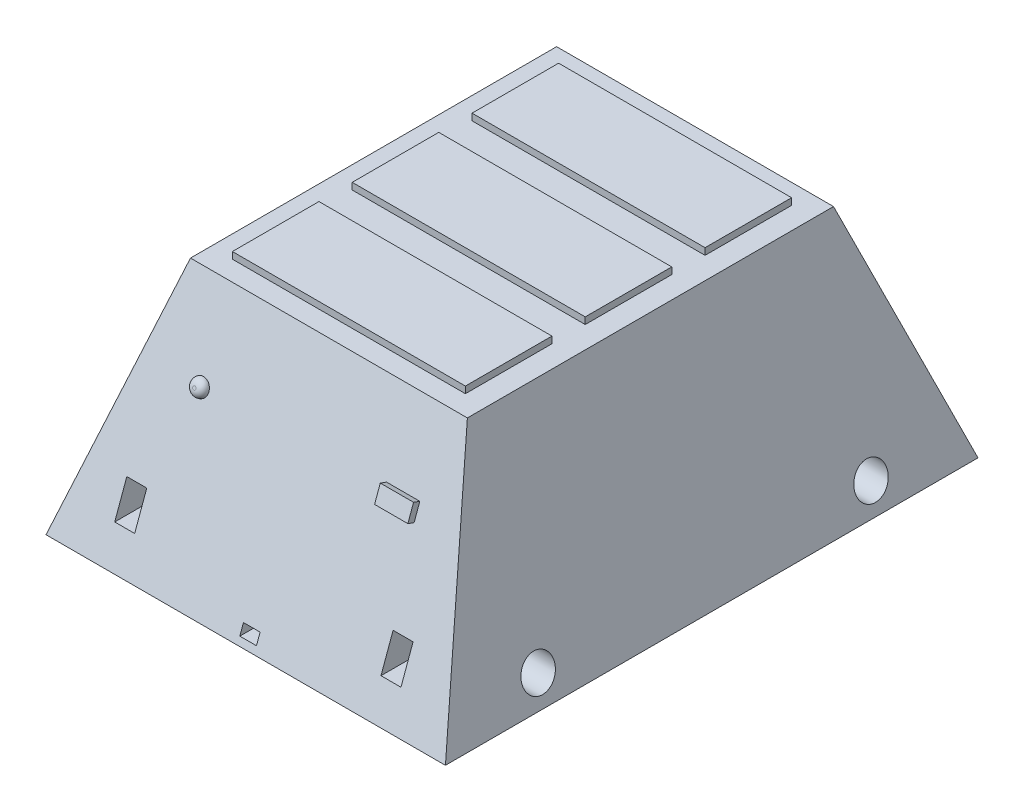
ISO-10303-21;
HEADER;
FILE_DESCRIPTION(('STEP AP214'),'2;1');
FILE_NAME('part.step','',(''),(''),'','','');
FILE_SCHEMA(('AUTOMOTIVE_DESIGN { 1 0 10303 214 1 1 1 1 }'));
ENDSEC;
DATA;
#1=APPLICATION_CONTEXT('core data for automotive mechanical design processes');
#2=APPLICATION_PROTOCOL_DEFINITION('international standard','automotive_design',2000,#1);
#3=PRODUCT_CONTEXT('',#1,'mechanical');
#4=PRODUCT('Part','Part','',(#3));
#5=PRODUCT_RELATED_PRODUCT_CATEGORY('part','',(#4));
#6=PRODUCT_DEFINITION_FORMATION('','',#4);
#7=PRODUCT_DEFINITION_CONTEXT('part definition',#1,'design');
#8=PRODUCT_DEFINITION('design','',#6,#7);
#9=PRODUCT_DEFINITION_SHAPE('','',#8);
#10=(LENGTH_UNIT() NAMED_UNIT(*) SI_UNIT(.MILLI.,.METRE.));
#11=(NAMED_UNIT(*) PLANE_ANGLE_UNIT() SI_UNIT($,.RADIAN.));
#12=(NAMED_UNIT(*) SI_UNIT($,.STERADIAN.) SOLID_ANGLE_UNIT());
#13=UNCERTAINTY_MEASURE_WITH_UNIT(LENGTH_MEASURE(1.E-05),#10,'distance_accuracy_value','');
#14=(GEOMETRIC_REPRESENTATION_CONTEXT(3) GLOBAL_UNCERTAINTY_ASSIGNED_CONTEXT((#13)) GLOBAL_UNIT_ASSIGNED_CONTEXT((#10,
#11,#12)) REPRESENTATION_CONTEXT('',''));
#15=CARTESIAN_POINT('',(0.,0.,0.));
#16=DIRECTION('',(0.,0.,1.));
#17=DIRECTION('',(1.,0.,0.));
#18=AXIS2_PLACEMENT_3D('',#15,#16,#17);
#19=CARTESIAN_POINT('',(76.2,43.6162040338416,69.85));
#20=DIRECTION('',(0.,-0.342020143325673,-0.939692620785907));
#21=DIRECTION('',(0.,0.939692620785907,-0.342020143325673));
#22=AXIS2_PLACEMENT_3D('',#19,#20,#21);
#23=PLANE('',#22);
#24=DIRECTION('',(-1.,0.,0.));
#25=VECTOR('',#24,1.);
#26=CARTESIAN_POINT('',(-54.61,-30.9162040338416,96.9775780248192));
#27=LINE('',#26,#25);
#28=CARTESIAN_POINT('',(-46.99,-30.9162040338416,96.9775780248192));
#29=VERTEX_POINT('',#28);
#30=CARTESIAN_POINT('',(-54.61,-30.9162040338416,96.9775780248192));
#31=VERTEX_POINT('',#30);
#32=EDGE_CURVE('E293',#29,#31,#27,.T.);
#33=ORIENTED_EDGE('',*,*,#32,.T.);
#34=DIRECTION('',(0.,0.939692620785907,-0.342020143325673));
#35=VECTOR('',#34,1.);
#36=CARTESIAN_POINT('',(-54.61,-23.8717981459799,94.4136239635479));
#37=LINE('',#36,#35);
#38=CARTESIAN_POINT('',(-54.61,-18.2162040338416,92.3551560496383));
#39=VERTEX_POINT('',#38);
#40=EDGE_CURVE('E289',#31,#39,#37,.T.);
#41=ORIENTED_EDGE('',*,*,#40,.T.);
#42=DIRECTION('',(1.,0.,0.));
#43=VECTOR('',#42,1.);
#44=CARTESIAN_POINT('',(-54.61,-18.2162040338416,92.3551560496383));
#45=LINE('',#44,#43);
#46=CARTESIAN_POINT('',(-46.99,-18.2162040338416,92.3551560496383));
#47=VERTEX_POINT('',#46);
#48=EDGE_CURVE('E292',#39,#47,#45,.T.);
#49=ORIENTED_EDGE('',*,*,#48,.T.);
#50=DIRECTION('',(0.,-0.939692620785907,0.342020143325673));
#51=VECTOR('',#50,1.);
#52=CARTESIAN_POINT('',(-46.99,-23.8717981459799,94.4136239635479));
#53=LINE('',#52,#51);
#54=EDGE_CURVE('E296',#47,#29,#53,.T.);
#55=ORIENTED_EDGE('',*,*,#54,.T.);
#56=EDGE_LOOP('',(#33,#41,#49,#55));
#57=FACE_BOUND('',#56,.T.);
#58=CARTESIAN_POINT('',(-38.1,13.7809633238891,80.7091395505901));
#59=DIRECTION('',(0.,-0.342020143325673,-0.939692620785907));
#60=DIRECTION('',(0.,0.939692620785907,-0.342020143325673));
#61=AXIS2_PLACEMENT_3D('',#58,#59,#60);
#62=CIRCLE('',#61,3.175);
#63=CARTESIAN_POINT('',(-38.1,16.7644873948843,79.6232255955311));
#64=VERTEX_POINT('',#63);
#65=EDGE_CURVE('E52',#64,#64,#62,.F.);
#66=ORIENTED_EDGE('',*,*,#65,.F.);
#67=EDGE_LOOP('',(#66));
#68=FACE_BOUND('',#67,.T.);
#69=DIRECTION('',(0.,0.939692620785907,-0.342020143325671));
#70=VECTOR('',#69,1.);
#71=CARTESIAN_POINT('',(44.45,16.7644873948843,79.6232255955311));
#72=LINE('',#71,#70);
#73=CARTESIAN_POINT('',(44.45,10.7974392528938,81.7950535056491));
#74=VERTEX_POINT('',#73);
#75=CARTESIAN_POINT('',(44.45,16.7644873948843,79.6232255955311));
#76=VERTEX_POINT('',#75);
#77=EDGE_CURVE('E474',#74,#76,#72,.T.);
#78=ORIENTED_EDGE('',*,*,#77,.F.);
#79=DIRECTION('',(1.,0.,0.));
#80=VECTOR('',#79,1.);
#81=CARTESIAN_POINT('',(31.75,10.7974392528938,81.7950535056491));
#82=LINE('',#81,#80);
#83=CARTESIAN_POINT('',(31.75,10.7974392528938,81.7950535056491));
#84=VERTEX_POINT('',#83);
#85=EDGE_CURVE('E464',#84,#74,#82,.T.);
#86=ORIENTED_EDGE('',*,*,#85,.F.);
#87=DIRECTION('',(0.,-0.939692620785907,0.342020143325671));
#88=VECTOR('',#87,1.);
#89=CARTESIAN_POINT('',(31.75,16.7644873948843,79.6232255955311));
#90=LINE('',#89,#88);
#91=CARTESIAN_POINT('',(31.75,16.7644873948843,79.6232255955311));
#92=VERTEX_POINT('',#91);
#93=EDGE_CURVE('E467',#92,#84,#90,.T.);
#94=ORIENTED_EDGE('',*,*,#93,.F.);
#95=DIRECTION('',(-1.,0.,0.));
#96=VECTOR('',#95,1.);
#97=CARTESIAN_POINT('',(31.75,16.7644873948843,79.6232255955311));
#98=LINE('',#97,#96);
#99=EDGE_CURVE('E471',#76,#92,#98,.T.);
#100=ORIENTED_EDGE('',*,*,#99,.F.);
#101=EDGE_LOOP('',(#78,#86,#94,#100));
#102=FACE_BOUND('',#101,.T.);
#103=DIRECTION('',(0.24416888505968,0.911250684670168,-0.331668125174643));
#104=VECTOR('',#103,1.);
#105=CARTESIAN_POINT('',(-45.1338085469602,72.3244008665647,59.4010708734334));
#106=LINE('',#105,#104);
#107=CARTESIAN_POINT('',(-52.8261467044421,43.6162040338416,69.85));
#108=VERTEX_POINT('',#107);
#109=CARTESIAN_POINT('',(-76.2,-43.6162040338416,101.6));
#110=VERTEX_POINT('',#109);
#111=EDGE_CURVE('E492',#108,#110,#106,.F.);
#112=ORIENTED_EDGE('',*,*,#111,.T.);
#113=DIRECTION('',(-1.,0.,0.));
#114=VECTOR('',#113,1.);
#115=CARTESIAN_POINT('',(76.2,-43.6162040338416,101.6));
#116=LINE('',#115,#114);
#117=CARTESIAN_POINT('',(76.2,-43.6162040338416,101.6));
#118=VERTEX_POINT('',#117);
#119=EDGE_CURVE('E514',#118,#110,#116,.T.);
#120=ORIENTED_EDGE('',*,*,#119,.F.);
#121=DIRECTION('',(0.24416888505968,-0.911250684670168,0.331668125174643));
#122=VECTOR('',#121,1.);
#123=CARTESIAN_POINT('',(54.2196594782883,38.4155435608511,71.7428856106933));
#124=LINE('',#123,#122);
#125=CARTESIAN_POINT('',(52.8261467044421,43.6162040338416,69.85));
#126=VERTEX_POINT('',#125);
#127=EDGE_CURVE('E500',#126,#118,#124,.T.);
#128=ORIENTED_EDGE('',*,*,#127,.F.);
#129=DIRECTION('',(-1.,0.,0.));
#130=VECTOR('',#129,1.);
#131=CARTESIAN_POINT('',(76.2,43.6162040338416,69.85));
#132=LINE('',#131,#130);
#133=EDGE_CURVE('E504',#126,#108,#132,.T.);
#134=ORIENTED_EDGE('',*,*,#133,.T.);
#135=EDGE_LOOP('',(#112,#120,#128,#134));
#136=FACE_BOUND('',#135,.T.);
#137=DIRECTION('',(-1.,0.,0.));
#138=VECTOR('',#137,1.);
#139=CARTESIAN_POINT('',(46.99,-30.9162040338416,96.9775780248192));
#140=LINE('',#139,#138);
#141=CARTESIAN_POINT('',(54.61,-30.9162040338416,96.9775780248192));
#142=VERTEX_POINT('',#141);
#143=CARTESIAN_POINT('',(46.99,-30.9162040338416,96.9775780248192));
#144=VERTEX_POINT('',#143);
#145=EDGE_CURVE('E322',#142,#144,#140,.T.);
#146=ORIENTED_EDGE('',*,*,#145,.T.);
#147=DIRECTION('',(0.,0.939692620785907,-0.342020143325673));
#148=VECTOR('',#147,1.);
#149=CARTESIAN_POINT('',(46.99,-23.8717981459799,94.4136239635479));
#150=LINE('',#149,#148);
#151=CARTESIAN_POINT('',(46.99,-18.2162040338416,92.3551560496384));
#152=VERTEX_POINT('',#151);
#153=EDGE_CURVE('E326',#144,#152,#150,.T.);
#154=ORIENTED_EDGE('',*,*,#153,.T.);
#155=DIRECTION('',(1.,0.,0.));
#156=VECTOR('',#155,1.);
#157=CARTESIAN_POINT('',(46.99,-18.2162040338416,92.3551560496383));
#158=LINE('',#157,#156);
#159=CARTESIAN_POINT('',(54.61,-18.2162040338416,92.3551560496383));
#160=VERTEX_POINT('',#159);
#161=EDGE_CURVE('E348',#152,#160,#158,.T.);
#162=ORIENTED_EDGE('',*,*,#161,.T.);
#163=DIRECTION('',(0.,-0.939692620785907,0.342020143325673));
#164=VECTOR('',#163,1.);
#165=CARTESIAN_POINT('',(54.61,-23.8717981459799,94.4136239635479));
#166=LINE('',#165,#164);
#167=EDGE_CURVE('E345',#160,#142,#166,.T.);
#168=ORIENTED_EDGE('',*,*,#167,.T.);
#169=EDGE_LOOP('',(#146,#154,#162,#168));
#170=FACE_BOUND('',#169,.T.);
#171=DIRECTION('',(-1.,0.,0.));
#172=VECTOR('',#171,1.);
#173=CARTESIAN_POINT('',(-3.175,-41.0762040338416,100.675515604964));
#174=LINE('',#173,#172);
#175=CARTESIAN_POINT('',(3.175,-41.0762040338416,100.675515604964));
#176=VERTEX_POINT('',#175);
#177=CARTESIAN_POINT('',(-3.175,-41.0762040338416,100.675515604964));
#178=VERTEX_POINT('',#177);
#179=EDGE_CURVE('E260',#176,#178,#174,.T.);
#180=ORIENTED_EDGE('',*,*,#179,.T.);
#181=DIRECTION('',(0.,0.939692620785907,-0.342020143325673));
#182=VECTOR('',#181,1.);
#183=CARTESIAN_POINT('',(-3.175,-43.3097539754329,101.48846130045));
#184=LINE('',#183,#182);
#185=CARTESIAN_POINT('',(-3.175,-37.2662040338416,99.2887890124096));
#186=VERTEX_POINT('',#185);
#187=EDGE_CURVE('E288',#178,#186,#184,.T.);
#188=ORIENTED_EDGE('',*,*,#187,.T.);
#189=DIRECTION('',(1.,0.,0.));
#190=VECTOR('',#189,1.);
#191=CARTESIAN_POINT('',(-3.175,-37.2662040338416,99.2887890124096));
#192=LINE('',#191,#190);
#193=CARTESIAN_POINT('',(3.175,-37.2662040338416,99.2887890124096));
#194=VERTEX_POINT('',#193);
#195=EDGE_CURVE('E547',#186,#194,#192,.T.);
#196=ORIENTED_EDGE('',*,*,#195,.T.);
#197=DIRECTION('',(0.,-0.939692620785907,0.342020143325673));
#198=VECTOR('',#197,1.);
#199=CARTESIAN_POINT('',(3.175,-43.3097539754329,101.48846130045));
#200=LINE('',#199,#198);
#201=EDGE_CURVE('E257',#194,#176,#200,.T.);
#202=ORIENTED_EDGE('',*,*,#201,.T.);
#203=EDGE_LOOP('',(#180,#188,#196,#202));
#204=FACE_BOUND('',#203,.T.);
#205=ADVANCED_FACE('F44',(#57,#68,#102,#136,#170,#204),#23,.F.);
#206=CARTESIAN_POINT('',(76.2,43.6162040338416,-69.85));
#207=DIRECTION('',(0.,-1.,0.));
#208=DIRECTION('',(0.,0.,-1.));
#209=AXIS2_PLACEMENT_3D('',#206,#207,#208);
#210=PLANE('',#209);
#211=DIRECTION('',(0.,0.,-1.));
#212=VECTOR('',#211,1.);
#213=CARTESIAN_POINT('',(44.4499999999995,43.6162040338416,-62.23));
#214=LINE('',#213,#212);
#215=CARTESIAN_POINT('',(44.4499999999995,43.6162040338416,-29.21));
#216=VERTEX_POINT('',#215);
#217=CARTESIAN_POINT('',(44.4499999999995,43.6162040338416,-62.23));
#218=VERTEX_POINT('',#217);
#219=EDGE_CURVE('E364',#216,#218,#214,.T.);
#220=ORIENTED_EDGE('',*,*,#219,.F.);
#221=DIRECTION('',(1.,0.,0.));
#222=VECTOR('',#221,1.);
#223=CARTESIAN_POINT('',(-44.4500000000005,43.6162040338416,-29.21));
#224=LINE('',#223,#222);
#225=CARTESIAN_POINT('',(-44.4500000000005,43.6162040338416,-29.21));
#226=VERTEX_POINT('',#225);
#227=EDGE_CURVE('E357',#226,#216,#224,.T.);
#228=ORIENTED_EDGE('',*,*,#227,.F.);
#229=DIRECTION('',(0.,0.,1.));
#230=VECTOR('',#229,1.);
#231=CARTESIAN_POINT('',(-44.4500000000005,43.6162040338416,-62.23));
#232=LINE('',#231,#230);
#233=CARTESIAN_POINT('',(-44.4500000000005,43.6162040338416,-62.23));
#234=VERTEX_POINT('',#233);
#235=EDGE_CURVE('E371',#234,#226,#232,.T.);
#236=ORIENTED_EDGE('',*,*,#235,.F.);
#237=DIRECTION('',(-1.,0.,0.));
#238=VECTOR('',#237,1.);
#239=CARTESIAN_POINT('',(-44.4500000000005,43.6162040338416,-62.23));
#240=LINE('',#239,#238);
#241=EDGE_CURVE('E367',#218,#234,#240,.T.);
#242=ORIENTED_EDGE('',*,*,#241,.F.);
#243=EDGE_LOOP('',(#220,#228,#236,#242));
#244=FACE_BOUND('',#243,.T.);
#245=DIRECTION('',(0.,0.,-1.));
#246=VECTOR('',#245,1.);
#247=CARTESIAN_POINT('',(-52.8261467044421,43.6162040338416,-69.85));
#248=LINE('',#247,#246);
#249=CARTESIAN_POINT('',(-52.8261467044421,43.6162040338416,-69.85));
#250=VERTEX_POINT('',#249);
#251=EDGE_CURVE('E520',#250,#108,#248,.F.);
#252=ORIENTED_EDGE('',*,*,#251,.T.);
#253=ORIENTED_EDGE('',*,*,#133,.F.);
#254=DIRECTION('',(0.,0.,1.));
#255=VECTOR('',#254,1.);
#256=CARTESIAN_POINT('',(52.8261467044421,43.6162040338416,-69.85));
#257=LINE('',#256,#255);
#258=CARTESIAN_POINT('',(52.8261467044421,43.6162040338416,-69.85));
#259=VERTEX_POINT('',#258);
#260=EDGE_CURVE('E508',#259,#126,#257,.T.);
#261=ORIENTED_EDGE('',*,*,#260,.F.);
#262=DIRECTION('',(-1.,0.,0.));
#263=VECTOR('',#262,1.);
#264=CARTESIAN_POINT('',(76.2,43.6162040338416,-69.85));
#265=LINE('',#264,#263);
#266=EDGE_CURVE('E507',#259,#250,#265,.T.);
#267=ORIENTED_EDGE('',*,*,#266,.T.);
#268=EDGE_LOOP('',(#252,#253,#261,#267));
#269=FACE_BOUND('',#268,.T.);
#270=DIRECTION('',(0.,0.,-1.));
#271=VECTOR('',#270,1.);
#272=CARTESIAN_POINT('',(44.4500000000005,43.6162040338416,29.21));
#273=LINE('',#272,#271);
#274=CARTESIAN_POINT('',(44.4500000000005,43.6162040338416,62.23));
#275=VERTEX_POINT('',#274);
#276=CARTESIAN_POINT('',(44.4500000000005,43.6162040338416,29.21));
#277=VERTEX_POINT('',#276);
#278=EDGE_CURVE('E392',#275,#277,#273,.T.);
#279=ORIENTED_EDGE('',*,*,#278,.F.);
#280=DIRECTION('',(1.,0.,0.));
#281=VECTOR('',#280,1.);
#282=CARTESIAN_POINT('',(-44.4499999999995,43.6162040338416,62.23));
#283=LINE('',#282,#281);
#284=CARTESIAN_POINT('',(-44.4499999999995,43.6162040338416,62.23));
#285=VERTEX_POINT('',#284);
#286=EDGE_CURVE('E433',#285,#275,#283,.T.);
#287=ORIENTED_EDGE('',*,*,#286,.F.);
#288=DIRECTION('',(0.,0.,1.));
#289=VECTOR('',#288,1.);
#290=CARTESIAN_POINT('',(-44.4499999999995,43.6162040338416,29.21));
#291=LINE('',#290,#289);
#292=CARTESIAN_POINT('',(-44.4499999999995,43.6162040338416,29.21));
#293=VERTEX_POINT('',#292);
#294=EDGE_CURVE('E436',#293,#285,#291,.T.);
#295=ORIENTED_EDGE('',*,*,#294,.F.);
#296=DIRECTION('',(-1.,0.,0.));
#297=VECTOR('',#296,1.);
#298=CARTESIAN_POINT('',(-44.4499999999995,43.6162040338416,29.21));
#299=LINE('',#298,#297);
#300=EDGE_CURVE('E440',#277,#293,#299,.T.);
#301=ORIENTED_EDGE('',*,*,#300,.F.);
#302=EDGE_LOOP('',(#279,#287,#295,#301));
#303=FACE_BOUND('',#302,.T.);
#304=DIRECTION('',(0.,0.,-1.));
#305=VECTOR('',#304,1.);
#306=CARTESIAN_POINT('',(44.45,43.6162040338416,-16.51));
#307=LINE('',#306,#305);
#308=CARTESIAN_POINT('',(44.45,43.6162040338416,16.51));
#309=VERTEX_POINT('',#308);
#310=CARTESIAN_POINT('',(44.45,43.6162040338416,-16.51));
#311=VERTEX_POINT('',#310);
#312=EDGE_CURVE('E368',#309,#311,#307,.T.);
#313=ORIENTED_EDGE('',*,*,#312,.F.);
#314=DIRECTION('',(1.,0.,0.));
#315=VECTOR('',#314,1.);
#316=CARTESIAN_POINT('',(-44.45,43.6162040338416,16.51));
#317=LINE('',#316,#315);
#318=CARTESIAN_POINT('',(-44.45,43.6162040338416,16.51));
#319=VERTEX_POINT('',#318);
#320=EDGE_CURVE('E402',#319,#309,#317,.T.);
#321=ORIENTED_EDGE('',*,*,#320,.F.);
#322=DIRECTION('',(0.,0.,1.));
#323=VECTOR('',#322,1.);
#324=CARTESIAN_POINT('',(-44.45,43.6162040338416,-16.51));
#325=LINE('',#324,#323);
#326=CARTESIAN_POINT('',(-44.45,43.6162040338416,-16.51));
#327=VERTEX_POINT('',#326);
#328=EDGE_CURVE('E405',#327,#319,#325,.T.);
#329=ORIENTED_EDGE('',*,*,#328,.F.);
#330=DIRECTION('',(-1.,0.,0.));
#331=VECTOR('',#330,1.);
#332=CARTESIAN_POINT('',(-44.45,43.6162040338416,-16.51));
#333=LINE('',#332,#331);
#334=EDGE_CURVE('E409',#311,#327,#333,.T.);
#335=ORIENTED_EDGE('',*,*,#334,.F.);
#336=EDGE_LOOP('',(#313,#321,#329,#335));
#337=FACE_BOUND('',#336,.T.);
#338=ADVANCED_FACE('F532',(#244,#269,#303,#337),#210,.F.);
#339=CARTESIAN_POINT('',(76.2,-43.6162040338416,101.6));
#340=DIRECTION('',(0.,1.,0.));
#341=DIRECTION('',(0.,0.,1.));
#342=AXIS2_PLACEMENT_3D('',#339,#340,#341);
#343=PLANE('',#342);
#344=DIRECTION('',(0.,0.,-1.));
#345=VECTOR('',#344,1.);
#346=CARTESIAN_POINT('',(-76.2,-43.6162040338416,101.6));
#347=LINE('',#346,#345);
#348=CARTESIAN_POINT('',(-76.2,-43.6162040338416,-101.6));
#349=VERTEX_POINT('',#348);
#350=EDGE_CURVE('E501',#110,#349,#347,.T.);
#351=ORIENTED_EDGE('',*,*,#350,.T.);
#352=DIRECTION('',(-1.,0.,0.));
#353=VECTOR('',#352,1.);
#354=CARTESIAN_POINT('',(76.2,-43.6162040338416,-101.6));
#355=LINE('',#354,#353);
#356=CARTESIAN_POINT('',(76.2,-43.6162040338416,-101.6));
#357=VERTEX_POINT('',#356);
#358=EDGE_CURVE('E511',#357,#349,#355,.T.);
#359=ORIENTED_EDGE('',*,*,#358,.F.);
#360=DIRECTION('',(0.,0.,-1.));
#361=VECTOR('',#360,1.);
#362=CARTESIAN_POINT('',(76.2,-43.6162040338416,101.6));
#363=LINE('',#362,#361);
#364=EDGE_CURVE('E497',#118,#357,#363,.T.);
#365=ORIENTED_EDGE('',*,*,#364,.F.);
#366=ORIENTED_EDGE('',*,*,#119,.T.);
#367=EDGE_LOOP('',(#351,#359,#365,#366));
#368=FACE_BOUND('',#367,.T.);
#369=ADVANCED_FACE('F695',(#368),#343,.F.);
#370=CARTESIAN_POINT('',(76.2,-43.6162040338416,-101.6));
#371=DIRECTION('',(0.,-0.342020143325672,0.939692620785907));
#372=DIRECTION('',(0.,-0.939692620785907,-0.342020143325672));
#373=AXIS2_PLACEMENT_3D('',#370,#371,#372);
#374=PLANE('',#373);
#375=DIRECTION('',(-0.24416888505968,-0.911250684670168,-0.331668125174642));
#376=VECTOR('',#375,1.);
#377=CARTESIAN_POINT('',(-67.1141490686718,-9.70734672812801,-89.25818526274));
#378=LINE('',#377,#376);
#379=EDGE_CURVE('E503',#349,#250,#378,.F.);
#380=ORIENTED_EDGE('',*,*,#379,.T.);
#381=ORIENTED_EDGE('',*,*,#266,.F.);
#382=DIRECTION('',(-0.24416888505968,0.911250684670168,0.331668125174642));
#383=VECTOR('',#382,1.);
#384=CARTESIAN_POINT('',(76.2,-43.6162040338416,-101.6));
#385=LINE('',#384,#383);
#386=EDGE_CURVE('E499',#357,#259,#385,.T.);
#387=ORIENTED_EDGE('',*,*,#386,.F.);
#388=ORIENTED_EDGE('',*,*,#358,.T.);
#389=EDGE_LOOP('',(#380,#381,#387,#388));
#390=FACE_BOUND('',#389,.T.);
#391=ADVANCED_FACE('F697',(#390),#374,.F.);
#392=CARTESIAN_POINT('',(76.2,-43.6162040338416,101.6));
#393=DIRECTION('',(0.965925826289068,0.258819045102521,0.));
#394=DIRECTION('',(-0.258819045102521,0.965925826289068,0.));
#395=AXIS2_PLACEMENT_3D('',#392,#393,#394);
#396=PLANE('',#395);
#397=CARTESIAN_POINT('',(73.4776362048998,-33.4562040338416,63.5));
#398=DIRECTION('',(0.965925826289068,0.258819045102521,0.));
#399=DIRECTION('',(-0.258819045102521,0.965925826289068,0.));
#400=AXIS2_PLACEMENT_3D('',#397,#398,#399);
#401=ELLIPSE('',#400,6.57400374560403,6.35);
#402=CARTESIAN_POINT('',(71.7761588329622,-27.1062040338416,63.5));
#403=VERTEX_POINT('',#402);
#404=EDGE_CURVE('E485',#403,#403,#401,.T.);
#405=ORIENTED_EDGE('',*,*,#404,.F.);
#406=EDGE_LOOP('',(#405));
#407=FACE_BOUND('',#406,.T.);
#408=CARTESIAN_POINT('',(73.4776362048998,-33.4562040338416,-63.5));
#409=DIRECTION('',(0.965925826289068,0.258819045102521,0.));
#410=DIRECTION('',(-0.258819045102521,0.965925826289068,0.));
#411=AXIS2_PLACEMENT_3D('',#408,#409,#410);
#412=ELLIPSE('',#411,6.57400374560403,6.35);
#413=CARTESIAN_POINT('',(71.7761588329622,-27.1062040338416,-63.5));
#414=VERTEX_POINT('',#413);
#415=EDGE_CURVE('E489',#414,#414,#412,.T.);
#416=ORIENTED_EDGE('',*,*,#415,.F.);
#417=EDGE_LOOP('',(#416));
#418=FACE_BOUND('',#417,.T.);
#419=ORIENTED_EDGE('',*,*,#127,.T.);
#420=ORIENTED_EDGE('',*,*,#364,.T.);
#421=ORIENTED_EDGE('',*,*,#386,.T.);
#422=ORIENTED_EDGE('',*,*,#260,.T.);
#423=EDGE_LOOP('',(#419,#420,#421,#422));
#424=FACE_BOUND('',#423,.T.);
#425=ADVANCED_FACE('F700',(#407,#418,#424),#396,.T.);
#426=CARTESIAN_POINT('',(-76.2,-43.6162040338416,101.6));
#427=DIRECTION('',(-0.965925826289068,0.258819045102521,0.));
#428=DIRECTION('',(-0.258819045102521,-0.965925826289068,0.));
#429=AXIS2_PLACEMENT_3D('',#426,#427,#428);
#430=PLANE('',#429);
#431=CARTESIAN_POINT('',(-73.4776362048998,-33.4562040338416,63.5));
#432=DIRECTION('',(-0.965925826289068,0.258819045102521,0.));
#433=DIRECTION('',(0.258819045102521,0.965925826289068,0.));
#434=AXIS2_PLACEMENT_3D('',#431,#432,#433);
#435=ELLIPSE('',#434,6.57400374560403,6.35);
#436=CARTESIAN_POINT('',(-71.7761588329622,-27.1062040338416,63.5));
#437=VERTEX_POINT('',#436);
#438=EDGE_CURVE('E488',#437,#437,#435,.T.);
#439=ORIENTED_EDGE('',*,*,#438,.F.);
#440=EDGE_LOOP('',(#439));
#441=FACE_BOUND('',#440,.T.);
#442=CARTESIAN_POINT('',(-73.4776362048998,-33.4562040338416,-63.5));
#443=DIRECTION('',(-0.965925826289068,0.258819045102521,0.));
#444=DIRECTION('',(0.258819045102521,0.965925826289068,0.));
#445=AXIS2_PLACEMENT_3D('',#442,#443,#444);
#446=ELLIPSE('',#445,6.57400374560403,6.35);
#447=CARTESIAN_POINT('',(-71.7761588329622,-27.1062040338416,-63.5));
#448=VERTEX_POINT('',#447);
#449=EDGE_CURVE('E477',#448,#448,#446,.T.);
#450=ORIENTED_EDGE('',*,*,#449,.F.);
#451=EDGE_LOOP('',(#450));
#452=FACE_BOUND('',#451,.T.);
#453=ORIENTED_EDGE('',*,*,#111,.F.);
#454=ORIENTED_EDGE('',*,*,#251,.F.);
#455=ORIENTED_EDGE('',*,*,#379,.F.);
#456=ORIENTED_EDGE('',*,*,#350,.F.);
#457=EDGE_LOOP('',(#453,#454,#455,#456));
#458=FACE_BOUND('',#457,.T.);
#459=ADVANCED_FACE('F691',(#441,#452,#458),#430,.T.);
#460=CARTESIAN_POINT('',(-91.7549375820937,-33.4562040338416,-63.5));
#461=DIRECTION('',(1.,0.,0.));
#462=DIRECTION('',(0.,0.,-1.));
#463=AXIS2_PLACEMENT_3D('',#460,#461,#462);
#464=CYLINDRICAL_SURFACE('',#463,6.35);
#465=ORIENTED_EDGE('',*,*,#449,.T.);
#466=EDGE_LOOP('',(#465));
#467=FACE_BOUND('',#466,.T.);
#468=ORIENTED_EDGE('',*,*,#415,.T.);
#469=EDGE_LOOP('',(#468));
#470=FACE_BOUND('',#469,.T.);
#471=ADVANCED_FACE('F687',(#467,#470),#464,.F.);
#472=CARTESIAN_POINT('',(-91.7549375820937,-33.4562040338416,63.5));
#473=DIRECTION('',(1.,0.,0.));
#474=DIRECTION('',(0.,0.,-1.));
#475=AXIS2_PLACEMENT_3D('',#472,#473,#474);
#476=CYLINDRICAL_SURFACE('',#475,6.35);
#477=ORIENTED_EDGE('',*,*,#438,.T.);
#478=EDGE_LOOP('',(#477));
#479=FACE_BOUND('',#478,.T.);
#480=ORIENTED_EDGE('',*,*,#404,.T.);
#481=EDGE_LOOP('',(#480));
#482=FACE_BOUND('',#481,.T.);
#483=ADVANCED_FACE('F669',(#479,#482),#476,.F.);
#484=CARTESIAN_POINT('',(44.45,17.6332185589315,82.0100448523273));
#485=DIRECTION('',(-1.,0.,0.));
#486=DIRECTION('',(0.,0.,1.));
#487=AXIS2_PLACEMENT_3D('',#484,#485,#486);
#488=PLANE('',#487);
#489=ORIENTED_EDGE('',*,*,#77,.T.);
#490=DIRECTION('',(0.,-0.342020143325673,-0.939692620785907));
#491=VECTOR('',#490,1.);
#492=CARTESIAN_POINT('',(44.45,17.6332185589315,82.0100448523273));
#493=LINE('',#492,#491);
#494=CARTESIAN_POINT('',(44.45,17.6332185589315,82.0100448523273));
#495=VERTEX_POINT('',#494);
#496=EDGE_CURVE('E387',#495,#76,#493,.T.);
#497=ORIENTED_EDGE('',*,*,#496,.F.);
#498=DIRECTION('',(0.,0.939692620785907,-0.342020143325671));
#499=VECTOR('',#498,1.);
#500=CARTESIAN_POINT('',(44.45,17.6332185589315,82.0100448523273));
#501=LINE('',#500,#499);
#502=CARTESIAN_POINT('',(44.45,11.666170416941,84.1818727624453));
#503=VERTEX_POINT('',#502);
#504=EDGE_CURVE('E468',#503,#495,#501,.T.);
#505=ORIENTED_EDGE('',*,*,#504,.F.);
#506=DIRECTION('',(0.,-0.342020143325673,-0.939692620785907));
#507=VECTOR('',#506,1.);
#508=CARTESIAN_POINT('',(44.45,11.666170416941,84.1818727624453));
#509=LINE('',#508,#507);
#510=EDGE_CURVE('E460',#503,#74,#509,.T.);
#511=ORIENTED_EDGE('',*,*,#510,.T.);
#512=EDGE_LOOP('',(#489,#497,#505,#511));
#513=FACE_BOUND('',#512,.T.);
#514=ADVANCED_FACE('F665',(#513),#488,.F.);
#515=CARTESIAN_POINT('',(31.75,17.6332185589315,82.0100448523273));
#516=DIRECTION('',(0.,-0.939692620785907,0.342020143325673));
#517=DIRECTION('',(0.,-0.342020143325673,-0.939692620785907));
#518=AXIS2_PLACEMENT_3D('',#515,#516,#517);
#519=PLANE('',#518);
#520=ORIENTED_EDGE('',*,*,#99,.T.);
#521=DIRECTION('',(0.,-0.342020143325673,-0.939692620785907));
#522=VECTOR('',#521,1.);
#523=CARTESIAN_POINT('',(31.75,17.6332185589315,82.0100448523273));
#524=LINE('',#523,#522);
#525=CARTESIAN_POINT('',(31.75,17.6332185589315,82.0100448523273));
#526=VERTEX_POINT('',#525);
#527=EDGE_CURVE('E454',#526,#92,#524,.T.);
#528=ORIENTED_EDGE('',*,*,#527,.F.);
#529=DIRECTION('',(-1.,0.,0.));
#530=VECTOR('',#529,1.);
#531=CARTESIAN_POINT('',(31.75,17.6332185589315,82.0100448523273));
#532=LINE('',#531,#530);
#533=EDGE_CURVE('E481',#495,#526,#532,.T.);
#534=ORIENTED_EDGE('',*,*,#533,.F.);
#535=ORIENTED_EDGE('',*,*,#496,.T.);
#536=EDGE_LOOP('',(#520,#528,#534,#535));
#537=FACE_BOUND('',#536,.T.);
#538=ADVANCED_FACE('F668',(#537),#519,.F.);
#539=CARTESIAN_POINT('',(31.75,17.6332185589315,82.0100448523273));
#540=DIRECTION('',(1.,0.,0.));
#541=DIRECTION('',(0.,0.,-1.));
#542=AXIS2_PLACEMENT_3D('',#539,#540,#541);
#543=PLANE('',#542);
#544=ORIENTED_EDGE('',*,*,#93,.T.);
#545=DIRECTION('',(0.,-0.342020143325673,-0.939692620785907));
#546=VECTOR('',#545,1.);
#547=CARTESIAN_POINT('',(31.75,11.666170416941,84.1818727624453));
#548=LINE('',#547,#546);
#549=CARTESIAN_POINT('',(31.75,11.666170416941,84.1818727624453));
#550=VERTEX_POINT('',#549);
#551=EDGE_CURVE('E457',#550,#84,#548,.T.);
#552=ORIENTED_EDGE('',*,*,#551,.F.);
#553=DIRECTION('',(0.,-0.939692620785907,0.342020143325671));
#554=VECTOR('',#553,1.);
#555=CARTESIAN_POINT('',(31.75,17.6332185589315,82.0100448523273));
#556=LINE('',#555,#554);
#557=EDGE_CURVE('E479',#526,#550,#556,.T.);
#558=ORIENTED_EDGE('',*,*,#557,.F.);
#559=ORIENTED_EDGE('',*,*,#527,.T.);
#560=EDGE_LOOP('',(#544,#552,#558,#559));
#561=FACE_BOUND('',#560,.T.);
#562=ADVANCED_FACE('F673',(#561),#543,.F.);
#563=CARTESIAN_POINT('',(31.75,11.666170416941,84.1818727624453));
#564=DIRECTION('',(0.,0.939692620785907,-0.342020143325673));
#565=DIRECTION('',(0.,0.342020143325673,0.939692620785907));
#566=AXIS2_PLACEMENT_3D('',#563,#564,#565);
#567=PLANE('',#566);
#568=ORIENTED_EDGE('',*,*,#85,.T.);
#569=ORIENTED_EDGE('',*,*,#510,.F.);
#570=DIRECTION('',(1.,0.,0.));
#571=VECTOR('',#570,1.);
#572=CARTESIAN_POINT('',(31.75,11.666170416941,84.1818727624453));
#573=LINE('',#572,#571);
#574=EDGE_CURVE('E463',#550,#503,#573,.T.);
#575=ORIENTED_EDGE('',*,*,#574,.F.);
#576=ORIENTED_EDGE('',*,*,#551,.T.);
#577=EDGE_LOOP('',(#568,#569,#575,#576));
#578=FACE_BOUND('',#577,.T.);
#579=ADVANCED_FACE('F677',(#578),#567,.F.);
#580=CARTESIAN_POINT('',(0.,28.4202150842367,78.0838991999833));
#581=DIRECTION('',(0.,0.342020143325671,0.939692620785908));
#582=DIRECTION('',(0.,-0.939692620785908,0.342020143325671));
#583=AXIS2_PLACEMENT_3D('',#580,#581,#582);
#584=PLANE('',#583);
#585=ORIENTED_EDGE('',*,*,#504,.T.);
#586=ORIENTED_EDGE('',*,*,#533,.T.);
#587=ORIENTED_EDGE('',*,*,#557,.T.);
#588=ORIENTED_EDGE('',*,*,#574,.T.);
#589=EDGE_LOOP('',(#585,#586,#587,#588));
#590=FACE_BOUND('',#589,.T.);
#591=ADVANCED_FACE('F663',(#590),#584,.T.);
#592=CARTESIAN_POINT('',(-38.1,14.6496944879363,83.0959588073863));
#593=DIRECTION('',(0.,0.342020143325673,0.939692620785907));
#594=DIRECTION('',(0.,-0.939692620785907,0.342020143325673));
#595=AXIS2_PLACEMENT_3D('',#592,#593,#594);
#596=PLANE('',#595);
#597=CARTESIAN_POINT('',(-38.1,14.6496944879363,83.0959588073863));
#598=DIRECTION('',(0.,0.342020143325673,0.939692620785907));
#599=DIRECTION('',(0.,-0.939692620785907,0.342020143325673));
#600=AXIS2_PLACEMENT_3D('',#597,#598,#599);
#601=CIRCLE('',#600,0.635000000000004);
#602=CARTESIAN_POINT('',(-38.1,14.0529896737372,83.3131415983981));
#603=VERTEX_POINT('',#602);
#604=EDGE_CURVE('E11',#603,#603,#601,.T.);
#605=ORIENTED_EDGE('',*,*,#604,.T.);
#606=EDGE_LOOP('',(#605));
#607=FACE_BOUND('',#606,.T.);
#608=ADVANCED_FACE('F645',(#607),#596,.T.);
#609=CARTESIAN_POINT('',(44.4500000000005,46.1562040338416,29.21));
#610=DIRECTION('',(-1.,0.,0.));
#611=DIRECTION('',(0.,0.,1.));
#612=AXIS2_PLACEMENT_3D('',#609,#610,#611);
#613=PLANE('',#612);
#614=ORIENTED_EDGE('',*,*,#278,.T.);
#615=DIRECTION('',(0.,-1.,0.));
#616=VECTOR('',#615,1.);
#617=CARTESIAN_POINT('',(44.4500000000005,46.1562040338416,29.21));
#618=LINE('',#617,#616);
#619=CARTESIAN_POINT('',(44.4500000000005,46.1562040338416,29.21));
#620=VERTEX_POINT('',#619);
#621=EDGE_CURVE('E299',#620,#277,#618,.T.);
#622=ORIENTED_EDGE('',*,*,#621,.F.);
#623=DIRECTION('',(0.,0.,-1.));
#624=VECTOR('',#623,1.);
#625=CARTESIAN_POINT('',(44.4500000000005,46.1562040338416,29.21));
#626=LINE('',#625,#624);
#627=CARTESIAN_POINT('',(44.4500000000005,46.1562040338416,62.23));
#628=VERTEX_POINT('',#627);
#629=EDGE_CURVE('E437',#628,#620,#626,.T.);
#630=ORIENTED_EDGE('',*,*,#629,.F.);
#631=DIRECTION('',(0.,-1.,0.));
#632=VECTOR('',#631,1.);
#633=CARTESIAN_POINT('',(44.4500000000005,46.1562040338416,62.23));
#634=LINE('',#633,#632);
#635=EDGE_CURVE('E429',#628,#275,#634,.T.);
#636=ORIENTED_EDGE('',*,*,#635,.T.);
#637=EDGE_LOOP('',(#614,#622,#630,#636));
#638=FACE_BOUND('',#637,.T.);
#639=ADVANCED_FACE('F641',(#638),#613,.F.);
#640=CARTESIAN_POINT('',(-44.4499999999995,46.1562040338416,29.21));
#641=DIRECTION('',(0.,0.,1.));
#642=DIRECTION('',(0.,-1.,0.));
#643=AXIS2_PLACEMENT_3D('',#640,#641,#642);
#644=PLANE('',#643);
#645=ORIENTED_EDGE('',*,*,#300,.T.);
#646=DIRECTION('',(0.,-1.,0.));
#647=VECTOR('',#646,1.);
#648=CARTESIAN_POINT('',(-44.4499999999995,46.1562040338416,29.21));
#649=LINE('',#648,#647);
#650=CARTESIAN_POINT('',(-44.4499999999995,46.1562040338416,29.21));
#651=VERTEX_POINT('',#650);
#652=EDGE_CURVE('E423',#651,#293,#649,.T.);
#653=ORIENTED_EDGE('',*,*,#652,.F.);
#654=DIRECTION('',(-1.,0.,0.));
#655=VECTOR('',#654,1.);
#656=CARTESIAN_POINT('',(-44.4499999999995,46.1562040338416,29.21));
#657=LINE('',#656,#655);
#658=EDGE_CURVE('E448',#620,#651,#657,.T.);
#659=ORIENTED_EDGE('',*,*,#658,.F.);
#660=ORIENTED_EDGE('',*,*,#621,.T.);
#661=EDGE_LOOP('',(#645,#653,#659,#660));
#662=FACE_BOUND('',#661,.T.);
#663=ADVANCED_FACE('F644',(#662),#644,.F.);
#664=CARTESIAN_POINT('',(-44.4499999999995,46.1562040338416,29.21));
#665=DIRECTION('',(1.,0.,0.));
#666=DIRECTION('',(0.,0.,-1.));
#667=AXIS2_PLACEMENT_3D('',#664,#665,#666);
#668=PLANE('',#667);
#669=ORIENTED_EDGE('',*,*,#294,.T.);
#670=DIRECTION('',(0.,-1.,0.));
#671=VECTOR('',#670,1.);
#672=CARTESIAN_POINT('',(-44.4499999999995,46.1562040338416,62.23));
#673=LINE('',#672,#671);
#674=CARTESIAN_POINT('',(-44.4499999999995,46.1562040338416,62.23));
#675=VERTEX_POINT('',#674);
#676=EDGE_CURVE('E426',#675,#285,#673,.T.);
#677=ORIENTED_EDGE('',*,*,#676,.F.);
#678=DIRECTION('',(0.,0.,1.));
#679=VECTOR('',#678,1.);
#680=CARTESIAN_POINT('',(-44.4499999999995,46.1562040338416,29.21));
#681=LINE('',#680,#679);
#682=EDGE_CURVE('E446',#651,#675,#681,.T.);
#683=ORIENTED_EDGE('',*,*,#682,.F.);
#684=ORIENTED_EDGE('',*,*,#652,.T.);
#685=EDGE_LOOP('',(#669,#677,#683,#684));
#686=FACE_BOUND('',#685,.T.);
#687=ADVANCED_FACE('F649',(#686),#668,.F.);
#688=CARTESIAN_POINT('',(-44.4499999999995,46.1562040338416,62.23));
#689=DIRECTION('',(0.,0.,-1.));
#690=DIRECTION('',(0.,1.,0.));
#691=AXIS2_PLACEMENT_3D('',#688,#689,#690);
#692=PLANE('',#691);
#693=ORIENTED_EDGE('',*,*,#286,.T.);
#694=ORIENTED_EDGE('',*,*,#635,.F.);
#695=DIRECTION('',(1.,0.,0.));
#696=VECTOR('',#695,1.);
#697=CARTESIAN_POINT('',(-44.4499999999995,46.1562040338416,62.23));
#698=LINE('',#697,#696);
#699=EDGE_CURVE('E432',#675,#628,#698,.T.);
#700=ORIENTED_EDGE('',*,*,#699,.F.);
#701=ORIENTED_EDGE('',*,*,#676,.T.);
#702=EDGE_LOOP('',(#693,#694,#700,#701));
#703=FACE_BOUND('',#702,.T.);
#704=ADVANCED_FACE('F653',(#703),#692,.F.);
#705=CARTESIAN_POINT('',(0.,46.1562040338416,0.));
#706=DIRECTION('',(0.,1.,0.));
#707=DIRECTION('',(0.,0.,1.));
#708=AXIS2_PLACEMENT_3D('',#705,#706,#707);
#709=PLANE('',#708);
#710=ORIENTED_EDGE('',*,*,#629,.T.);
#711=ORIENTED_EDGE('',*,*,#658,.T.);
#712=ORIENTED_EDGE('',*,*,#682,.T.);
#713=ORIENTED_EDGE('',*,*,#699,.T.);
#714=EDGE_LOOP('',(#710,#711,#712,#713));
#715=FACE_BOUND('',#714,.T.);
#716=ADVANCED_FACE('F621',(#715),#709,.T.);
#717=CARTESIAN_POINT('',(44.4499999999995,46.1562040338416,-62.23));
#718=DIRECTION('',(-1.,0.,0.));
#719=DIRECTION('',(0.,0.,1.));
#720=AXIS2_PLACEMENT_3D('',#717,#718,#719);
#721=PLANE('',#720);
#722=ORIENTED_EDGE('',*,*,#219,.T.);
#723=DIRECTION('',(0.,-1.,0.));
#724=VECTOR('',#723,1.);
#725=CARTESIAN_POINT('',(44.4499999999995,46.1562040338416,-62.23));
#726=LINE('',#725,#724);
#727=CARTESIAN_POINT('',(44.4499999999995,46.1562040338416,-62.23));
#728=VERTEX_POINT('',#727);
#729=EDGE_CURVE('E384',#728,#218,#726,.T.);
#730=ORIENTED_EDGE('',*,*,#729,.F.);
#731=DIRECTION('',(0.,0.,-1.));
#732=VECTOR('',#731,1.);
#733=CARTESIAN_POINT('',(44.4499999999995,46.1562040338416,-62.23));
#734=LINE('',#733,#732);
#735=CARTESIAN_POINT('',(44.4499999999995,46.1562040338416,-29.21));
#736=VERTEX_POINT('',#735);
#737=EDGE_CURVE('E353',#736,#728,#734,.T.);
#738=ORIENTED_EDGE('',*,*,#737,.F.);
#739=DIRECTION('',(0.,-1.,0.));
#740=VECTOR('',#739,1.);
#741=CARTESIAN_POINT('',(44.4499999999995,46.1562040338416,-29.21));
#742=LINE('',#741,#740);
#743=EDGE_CURVE('E363',#736,#216,#742,.T.);
#744=ORIENTED_EDGE('',*,*,#743,.T.);
#745=EDGE_LOOP('',(#722,#730,#738,#744));
#746=FACE_BOUND('',#745,.T.);
#747=ADVANCED_FACE('F617',(#746),#721,.F.);
#748=CARTESIAN_POINT('',(-44.4500000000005,46.1562040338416,-62.23));
#749=DIRECTION('',(0.,0.,1.));
#750=DIRECTION('',(0.,-1.,0.));
#751=AXIS2_PLACEMENT_3D('',#748,#749,#750);
#752=PLANE('',#751);
#753=ORIENTED_EDGE('',*,*,#241,.T.);
#754=DIRECTION('',(0.,-1.,0.));
#755=VECTOR('',#754,1.);
#756=CARTESIAN_POINT('',(-44.4500000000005,46.1562040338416,-62.23));
#757=LINE('',#756,#755);
#758=CARTESIAN_POINT('',(-44.4500000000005,46.1562040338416,-62.23));
#759=VERTEX_POINT('',#758);
#760=EDGE_CURVE('E381',#759,#234,#757,.T.);
#761=ORIENTED_EDGE('',*,*,#760,.F.);
#762=DIRECTION('',(-1.,0.,0.));
#763=VECTOR('',#762,1.);
#764=CARTESIAN_POINT('',(-44.4500000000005,46.1562040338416,-62.23));
#765=LINE('',#764,#763);
#766=EDGE_CURVE('E356',#728,#759,#765,.T.);
#767=ORIENTED_EDGE('',*,*,#766,.F.);
#768=ORIENTED_EDGE('',*,*,#729,.T.);
#769=EDGE_LOOP('',(#753,#761,#767,#768));
#770=FACE_BOUND('',#769,.T.);
#771=ADVANCED_FACE('F613',(#770),#752,.F.);
#772=CARTESIAN_POINT('',(-44.4500000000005,46.1562040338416,-62.23));
#773=DIRECTION('',(1.,0.,0.));
#774=DIRECTION('',(0.,0.,-1.));
#775=AXIS2_PLACEMENT_3D('',#772,#773,#774);
#776=PLANE('',#775);
#777=ORIENTED_EDGE('',*,*,#235,.T.);
#778=DIRECTION('',(0.,-1.,0.));
#779=VECTOR('',#778,1.);
#780=CARTESIAN_POINT('',(-44.4500000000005,46.1562040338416,-29.21));
#781=LINE('',#780,#779);
#782=CARTESIAN_POINT('',(-44.4500000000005,46.1562040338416,-29.21));
#783=VERTEX_POINT('',#782);
#784=EDGE_CURVE('E378',#783,#226,#781,.T.);
#785=ORIENTED_EDGE('',*,*,#784,.F.);
#786=DIRECTION('',(0.,0.,1.));
#787=VECTOR('',#786,1.);
#788=CARTESIAN_POINT('',(-44.4500000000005,46.1562040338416,-62.23));
#789=LINE('',#788,#787);
#790=EDGE_CURVE('E359',#759,#783,#789,.T.);
#791=ORIENTED_EDGE('',*,*,#790,.F.);
#792=ORIENTED_EDGE('',*,*,#760,.T.);
#793=EDGE_LOOP('',(#777,#785,#791,#792));
#794=FACE_BOUND('',#793,.T.);
#795=ADVANCED_FACE('F609',(#794),#776,.F.);
#796=CARTESIAN_POINT('',(-44.4500000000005,46.1562040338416,-29.21));
#797=DIRECTION('',(0.,0.,-1.));
#798=DIRECTION('',(0.,1.,0.));
#799=AXIS2_PLACEMENT_3D('',#796,#797,#798);
#800=PLANE('',#799);
#801=ORIENTED_EDGE('',*,*,#227,.T.);
#802=ORIENTED_EDGE('',*,*,#743,.F.);
#803=DIRECTION('',(1.,0.,0.));
#804=VECTOR('',#803,1.);
#805=CARTESIAN_POINT('',(-44.4500000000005,46.1562040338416,-29.21));
#806=LINE('',#805,#804);
#807=EDGE_CURVE('E361',#783,#736,#806,.T.);
#808=ORIENTED_EDGE('',*,*,#807,.F.);
#809=ORIENTED_EDGE('',*,*,#784,.T.);
#810=EDGE_LOOP('',(#801,#802,#808,#809));
#811=FACE_BOUND('',#810,.T.);
#812=ADVANCED_FACE('F605',(#811),#800,.F.);
#813=CARTESIAN_POINT('',(0.,46.1562040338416,0.));
#814=DIRECTION('',(0.,1.,0.));
#815=DIRECTION('',(0.,0.,1.));
#816=AXIS2_PLACEMENT_3D('',#813,#814,#815);
#817=PLANE('',#816);
#818=ORIENTED_EDGE('',*,*,#737,.T.);
#819=ORIENTED_EDGE('',*,*,#766,.T.);
#820=ORIENTED_EDGE('',*,*,#790,.T.);
#821=ORIENTED_EDGE('',*,*,#807,.T.);
#822=EDGE_LOOP('',(#818,#819,#820,#821));
#823=FACE_BOUND('',#822,.T.);
#824=ADVANCED_FACE('F601',(#823),#817,.T.);
#825=CARTESIAN_POINT('',(44.45,46.1562040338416,-16.51));
#826=DIRECTION('',(-1.,0.,0.));
#827=DIRECTION('',(0.,0.,1.));
#828=AXIS2_PLACEMENT_3D('',#825,#826,#827);
#829=PLANE('',#828);
#830=ORIENTED_EDGE('',*,*,#312,.T.);
#831=DIRECTION('',(0.,-1.,0.));
#832=VECTOR('',#831,1.);
#833=CARTESIAN_POINT('',(44.45,46.1562040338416,-16.51));
#834=LINE('',#833,#832);
#835=CARTESIAN_POINT('',(44.45,46.1562040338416,-16.51));
#836=VERTEX_POINT('',#835);
#837=EDGE_CURVE('E388',#836,#311,#834,.T.);
#838=ORIENTED_EDGE('',*,*,#837,.F.);
#839=DIRECTION('',(0.,0.,-1.));
#840=VECTOR('',#839,1.);
#841=CARTESIAN_POINT('',(44.45,46.1562040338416,-16.51));
#842=LINE('',#841,#840);
#843=CARTESIAN_POINT('',(44.45,46.1562040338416,16.51));
#844=VERTEX_POINT('',#843);
#845=EDGE_CURVE('E406',#844,#836,#842,.T.);
#846=ORIENTED_EDGE('',*,*,#845,.F.);
#847=DIRECTION('',(0.,-1.,0.));
#848=VECTOR('',#847,1.);
#849=CARTESIAN_POINT('',(44.45,46.1562040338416,16.51));
#850=LINE('',#849,#848);
#851=EDGE_CURVE('E398',#844,#309,#850,.T.);
#852=ORIENTED_EDGE('',*,*,#851,.T.);
#853=EDGE_LOOP('',(#830,#838,#846,#852));
#854=FACE_BOUND('',#853,.T.);
#855=ADVANCED_FACE('F604',(#854),#829,.F.);
#856=CARTESIAN_POINT('',(-44.45,46.1562040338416,-16.51));
#857=DIRECTION('',(0.,0.,1.));
#858=DIRECTION('',(0.,-1.,0.));
#859=AXIS2_PLACEMENT_3D('',#856,#857,#858);
#860=PLANE('',#859);
#861=ORIENTED_EDGE('',*,*,#334,.T.);
#862=DIRECTION('',(0.,-1.,0.));
#863=VECTOR('',#862,1.);
#864=CARTESIAN_POINT('',(-44.45,46.1562040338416,-16.51));
#865=LINE('',#864,#863);
#866=CARTESIAN_POINT('',(-44.45,46.1562040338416,-16.51));
#867=VERTEX_POINT('',#866);
#868=EDGE_CURVE('E391',#867,#327,#865,.T.);
#869=ORIENTED_EDGE('',*,*,#868,.F.);
#870=DIRECTION('',(-1.,0.,0.));
#871=VECTOR('',#870,1.);
#872=CARTESIAN_POINT('',(-44.45,46.1562040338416,-16.51));
#873=LINE('',#872,#871);
#874=EDGE_CURVE('E417',#836,#867,#873,.T.);
#875=ORIENTED_EDGE('',*,*,#874,.F.);
#876=ORIENTED_EDGE('',*,*,#837,.T.);
#877=EDGE_LOOP('',(#861,#869,#875,#876));
#878=FACE_BOUND('',#877,.T.);
#879=ADVANCED_FACE('F625',(#878),#860,.F.);
#880=CARTESIAN_POINT('',(-44.45,46.1562040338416,-16.51));
#881=DIRECTION('',(1.,0.,0.));
#882=DIRECTION('',(0.,0.,-1.));
#883=AXIS2_PLACEMENT_3D('',#880,#881,#882);
#884=PLANE('',#883);
#885=ORIENTED_EDGE('',*,*,#328,.T.);
#886=DIRECTION('',(0.,-1.,0.));
#887=VECTOR('',#886,1.);
#888=CARTESIAN_POINT('',(-44.45,46.1562040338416,16.51));
#889=LINE('',#888,#887);
#890=CARTESIAN_POINT('',(-44.45,46.1562040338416,16.51));
#891=VERTEX_POINT('',#890);
#892=EDGE_CURVE('E395',#891,#319,#889,.T.);
#893=ORIENTED_EDGE('',*,*,#892,.F.);
#894=DIRECTION('',(0.,0.,1.));
#895=VECTOR('',#894,1.);
#896=CARTESIAN_POINT('',(-44.45,46.1562040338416,-16.51));
#897=LINE('',#896,#895);
#898=EDGE_CURVE('E415',#867,#891,#897,.T.);
#899=ORIENTED_EDGE('',*,*,#898,.F.);
#900=ORIENTED_EDGE('',*,*,#868,.T.);
#901=EDGE_LOOP('',(#885,#893,#899,#900));
#902=FACE_BOUND('',#901,.T.);
#903=ADVANCED_FACE('F629',(#902),#884,.F.);
#904=CARTESIAN_POINT('',(-44.45,46.1562040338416,16.51));
#905=DIRECTION('',(0.,0.,-1.));
#906=DIRECTION('',(0.,1.,0.));
#907=AXIS2_PLACEMENT_3D('',#904,#905,#906);
#908=PLANE('',#907);
#909=ORIENTED_EDGE('',*,*,#320,.T.);
#910=ORIENTED_EDGE('',*,*,#851,.F.);
#911=DIRECTION('',(1.,0.,0.));
#912=VECTOR('',#911,1.);
#913=CARTESIAN_POINT('',(-44.45,46.1562040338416,16.51));
#914=LINE('',#913,#912);
#915=EDGE_CURVE('E401',#891,#844,#914,.T.);
#916=ORIENTED_EDGE('',*,*,#915,.F.);
#917=ORIENTED_EDGE('',*,*,#892,.T.);
#918=EDGE_LOOP('',(#909,#910,#916,#917));
#919=FACE_BOUND('',#918,.T.);
#920=ADVANCED_FACE('F633',(#919),#908,.F.);
#921=CARTESIAN_POINT('',(0.,46.1562040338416,0.));
#922=DIRECTION('',(0.,1.,0.));
#923=DIRECTION('',(0.,0.,1.));
#924=AXIS2_PLACEMENT_3D('',#921,#922,#923);
#925=PLANE('',#924);
#926=ORIENTED_EDGE('',*,*,#845,.T.);
#927=ORIENTED_EDGE('',*,*,#874,.T.);
#928=ORIENTED_EDGE('',*,*,#898,.T.);
#929=ORIENTED_EDGE('',*,*,#915,.T.);
#930=EDGE_LOOP('',(#926,#927,#928,#929));
#931=FACE_BOUND('',#930,.T.);
#932=ADVANCED_FACE('F599',(#931),#925,.T.);
#933=CARTESIAN_POINT('',(0.,0.,69.85));
#934=DIRECTION('',(0.,0.,1.));
#935=DIRECTION('',(1.,0.,0.));
#936=AXIS2_PLACEMENT_3D('',#933,#934,#935);
#937=PLANE('',#936);
#938=DIRECTION('',(0.,1.,0.));
#939=VECTOR('',#938,1.);
#940=CARTESIAN_POINT('',(54.61,-18.2162040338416,69.85));
#941=LINE('',#940,#939);
#942=CARTESIAN_POINT('',(54.61,-30.9162040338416,69.85));
#943=VERTEX_POINT('',#942);
#944=CARTESIAN_POINT('',(54.61,-18.2162040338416,69.85));
#945=VERTEX_POINT('',#944);
#946=EDGE_CURVE('E304',#943,#945,#941,.T.);
#947=ORIENTED_EDGE('',*,*,#946,.T.);
#948=DIRECTION('',(-1.,0.,0.));
#949=VECTOR('',#948,1.);
#950=CARTESIAN_POINT('',(46.99,-18.2162040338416,69.85));
#951=LINE('',#950,#949);
#952=CARTESIAN_POINT('',(46.99,-18.2162040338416,69.85));
#953=VERTEX_POINT('',#952);
#954=EDGE_CURVE('E340',#945,#953,#951,.T.);
#955=ORIENTED_EDGE('',*,*,#954,.T.);
#956=DIRECTION('',(0.,-1.,0.));
#957=VECTOR('',#956,1.);
#958=CARTESIAN_POINT('',(46.99,-18.2162040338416,69.85));
#959=LINE('',#958,#957);
#960=CARTESIAN_POINT('',(46.99,-30.9162040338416,69.85));
#961=VERTEX_POINT('',#960);
#962=EDGE_CURVE('E337',#953,#961,#959,.T.);
#963=ORIENTED_EDGE('',*,*,#962,.T.);
#964=DIRECTION('',(1.,0.,0.));
#965=VECTOR('',#964,1.);
#966=CARTESIAN_POINT('',(46.99,-30.9162040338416,69.85));
#967=LINE('',#966,#965);
#968=EDGE_CURVE('E334',#961,#943,#967,.T.);
#969=ORIENTED_EDGE('',*,*,#968,.T.);
#970=EDGE_LOOP('',(#947,#955,#963,#969));
#971=FACE_BOUND('',#970,.T.);
#972=ADVANCED_FACE('F595',(#971),#937,.T.);
#973=CARTESIAN_POINT('',(46.99,-30.9162040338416,109.952241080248));
#974=DIRECTION('',(0.,1.,0.));
#975=DIRECTION('',(0.,0.,1.));
#976=AXIS2_PLACEMENT_3D('',#973,#974,#975);
#977=PLANE('',#976);
#978=DIRECTION('',(0.,0.,-1.));
#979=VECTOR('',#978,1.);
#980=CARTESIAN_POINT('',(54.61,-30.9162040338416,109.952241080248));
#981=LINE('',#980,#979);
#982=EDGE_CURVE('E332',#142,#943,#981,.T.);
#983=ORIENTED_EDGE('',*,*,#982,.T.);
#984=ORIENTED_EDGE('',*,*,#968,.F.);
#985=DIRECTION('',(0.,0.,-1.));
#986=VECTOR('',#985,1.);
#987=CARTESIAN_POINT('',(46.99,-30.9162040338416,109.952241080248));
#988=LINE('',#987,#986);
#989=EDGE_CURVE('E330',#144,#961,#988,.T.);
#990=ORIENTED_EDGE('',*,*,#989,.F.);
#991=ORIENTED_EDGE('',*,*,#145,.F.);
#992=EDGE_LOOP('',(#983,#984,#990,#991));
#993=FACE_BOUND('',#992,.T.);
#994=ADVANCED_FACE('F591',(#993),#977,.T.);
#995=CARTESIAN_POINT('',(46.99,-18.2162040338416,109.952241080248));
#996=DIRECTION('',(1.,0.,0.));
#997=DIRECTION('',(0.,0.,-1.));
#998=AXIS2_PLACEMENT_3D('',#995,#996,#997);
#999=PLANE('',#998);
#1000=ORIENTED_EDGE('',*,*,#989,.T.);
#1001=ORIENTED_EDGE('',*,*,#962,.F.);
#1002=DIRECTION('',(0.,0.,-1.));
#1003=VECTOR('',#1002,1.);
#1004=CARTESIAN_POINT('',(46.99,-18.2162040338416,109.952241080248));
#1005=LINE('',#1004,#1003);
#1006=EDGE_CURVE('E328',#152,#953,#1005,.T.);
#1007=ORIENTED_EDGE('',*,*,#1006,.F.);
#1008=ORIENTED_EDGE('',*,*,#153,.F.);
#1009=EDGE_LOOP('',(#1000,#1001,#1007,#1008));
#1010=FACE_BOUND('',#1009,.T.);
#1011=ADVANCED_FACE('F587',(#1010),#999,.T.);
#1012=CARTESIAN_POINT('',(46.99,-18.2162040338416,109.952241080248));
#1013=DIRECTION('',(0.,-1.,0.));
#1014=DIRECTION('',(0.,0.,-1.));
#1015=AXIS2_PLACEMENT_3D('',#1012,#1013,#1014);
#1016=PLANE('',#1015);
#1017=ORIENTED_EDGE('',*,*,#1006,.T.);
#1018=ORIENTED_EDGE('',*,*,#954,.F.);
#1019=DIRECTION('',(0.,0.,-1.));
#1020=VECTOR('',#1019,1.);
#1021=CARTESIAN_POINT('',(54.61,-18.2162040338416,109.952241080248));
#1022=LINE('',#1021,#1020);
#1023=EDGE_CURVE('E325',#160,#945,#1022,.T.);
#1024=ORIENTED_EDGE('',*,*,#1023,.F.);
#1025=ORIENTED_EDGE('',*,*,#161,.F.);
#1026=EDGE_LOOP('',(#1017,#1018,#1024,#1025));
#1027=FACE_BOUND('',#1026,.T.);
#1028=ADVANCED_FACE('F583',(#1027),#1016,.T.);
#1029=CARTESIAN_POINT('',(54.61,-18.2162040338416,109.952241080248));
#1030=DIRECTION('',(-1.,0.,0.));
#1031=DIRECTION('',(0.,0.,1.));
#1032=AXIS2_PLACEMENT_3D('',#1029,#1030,#1031);
#1033=PLANE('',#1032);
#1034=ORIENTED_EDGE('',*,*,#1023,.T.);
#1035=ORIENTED_EDGE('',*,*,#946,.F.);
#1036=ORIENTED_EDGE('',*,*,#982,.F.);
#1037=ORIENTED_EDGE('',*,*,#167,.F.);
#1038=EDGE_LOOP('',(#1034,#1035,#1036,#1037));
#1039=FACE_BOUND('',#1038,.T.);
#1040=ADVANCED_FACE('F565',(#1039),#1033,.T.);
#1041=CARTESIAN_POINT('',(0.,0.,69.85));
#1042=DIRECTION('',(0.,0.,1.));
#1043=DIRECTION('',(1.,0.,0.));
#1044=AXIS2_PLACEMENT_3D('',#1041,#1042,#1043);
#1045=PLANE('',#1044);
#1046=DIRECTION('',(0.,1.,0.));
#1047=VECTOR('',#1046,1.);
#1048=CARTESIAN_POINT('',(-46.99,-18.2162040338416,69.85));
#1049=LINE('',#1048,#1047);
#1050=CARTESIAN_POINT('',(-46.99,-30.9162040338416,69.85));
#1051=VERTEX_POINT('',#1050);
#1052=CARTESIAN_POINT('',(-46.99,-18.2162040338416,69.85));
#1053=VERTEX_POINT('',#1052);
#1054=EDGE_CURVE('E300',#1051,#1053,#1049,.T.);
#1055=ORIENTED_EDGE('',*,*,#1054,.T.);
#1056=DIRECTION('',(-1.,0.,0.));
#1057=VECTOR('',#1056,1.);
#1058=CARTESIAN_POINT('',(-54.61,-18.2162040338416,69.85));
#1059=LINE('',#1058,#1057);
#1060=CARTESIAN_POINT('',(-54.61,-18.2162040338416,69.85));
#1061=VERTEX_POINT('',#1060);
#1062=EDGE_CURVE('E303',#1053,#1061,#1059,.T.);
#1063=ORIENTED_EDGE('',*,*,#1062,.T.);
#1064=DIRECTION('',(0.,-1.,0.));
#1065=VECTOR('',#1064,1.);
#1066=CARTESIAN_POINT('',(-54.61,-18.2162040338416,69.85));
#1067=LINE('',#1066,#1065);
#1068=CARTESIAN_POINT('',(-54.61,-30.9162040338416,69.85));
#1069=VERTEX_POINT('',#1068);
#1070=EDGE_CURVE('E307',#1061,#1069,#1067,.T.);
#1071=ORIENTED_EDGE('',*,*,#1070,.T.);
#1072=DIRECTION('',(1.,0.,0.));
#1073=VECTOR('',#1072,1.);
#1074=CARTESIAN_POINT('',(-54.61,-30.9162040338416,69.85));
#1075=LINE('',#1074,#1073);
#1076=EDGE_CURVE('E310',#1069,#1051,#1075,.T.);
#1077=ORIENTED_EDGE('',*,*,#1076,.T.);
#1078=EDGE_LOOP('',(#1055,#1063,#1071,#1077));
#1079=FACE_BOUND('',#1078,.T.);
#1080=ADVANCED_FACE('F561',(#1079),#1045,.T.);
#1081=CARTESIAN_POINT('',(-54.61,-30.9162040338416,109.952241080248));
#1082=DIRECTION('',(0.,1.,0.));
#1083=DIRECTION('',(0.,0.,1.));
#1084=AXIS2_PLACEMENT_3D('',#1081,#1082,#1083);
#1085=PLANE('',#1084);
#1086=DIRECTION('',(0.,0.,-1.));
#1087=VECTOR('',#1086,1.);
#1088=CARTESIAN_POINT('',(-46.99,-30.9162040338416,109.952241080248));
#1089=LINE('',#1088,#1087);
#1090=EDGE_CURVE('E67',#29,#1051,#1089,.T.);
#1091=ORIENTED_EDGE('',*,*,#1090,.T.);
#1092=ORIENTED_EDGE('',*,*,#1076,.F.);
#1093=DIRECTION('',(0.,0.,-1.));
#1094=VECTOR('',#1093,1.);
#1095=CARTESIAN_POINT('',(-54.61,-30.9162040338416,109.952241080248));
#1096=LINE('',#1095,#1094);
#1097=EDGE_CURVE('E314',#31,#1069,#1096,.T.);
#1098=ORIENTED_EDGE('',*,*,#1097,.F.);
#1099=ORIENTED_EDGE('',*,*,#32,.F.);
#1100=EDGE_LOOP('',(#1091,#1092,#1098,#1099));
#1101=FACE_BOUND('',#1100,.T.);
#1102=ADVANCED_FACE('F564',(#1101),#1085,.T.);
#1103=CARTESIAN_POINT('',(-54.61,-18.2162040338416,109.952241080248));
#1104=DIRECTION('',(1.,0.,0.));
#1105=DIRECTION('',(0.,0.,-1.));
#1106=AXIS2_PLACEMENT_3D('',#1103,#1104,#1105);
#1107=PLANE('',#1106);
#1108=ORIENTED_EDGE('',*,*,#1097,.T.);
#1109=ORIENTED_EDGE('',*,*,#1070,.F.);
#1110=DIRECTION('',(0.,0.,-1.));
#1111=VECTOR('',#1110,1.);
#1112=CARTESIAN_POINT('',(-54.61,-18.2162040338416,109.952241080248));
#1113=LINE('',#1112,#1111);
#1114=EDGE_CURVE('E316',#39,#1061,#1113,.T.);
#1115=ORIENTED_EDGE('',*,*,#1114,.F.);
#1116=ORIENTED_EDGE('',*,*,#40,.F.);
#1117=EDGE_LOOP('',(#1108,#1109,#1115,#1116));
#1118=FACE_BOUND('',#1117,.T.);
#1119=ADVANCED_FACE('F569',(#1118),#1107,.T.);
#1120=CARTESIAN_POINT('',(-54.61,-18.2162040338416,109.952241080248));
#1121=DIRECTION('',(0.,-1.,0.));
#1122=DIRECTION('',(0.,0.,-1.));
#1123=AXIS2_PLACEMENT_3D('',#1120,#1121,#1122);
#1124=PLANE('',#1123);
#1125=ORIENTED_EDGE('',*,*,#1114,.T.);
#1126=ORIENTED_EDGE('',*,*,#1062,.F.);
#1127=DIRECTION('',(0.,0.,-1.));
#1128=VECTOR('',#1127,1.);
#1129=CARTESIAN_POINT('',(-46.99,-18.2162040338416,109.952241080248));
#1130=LINE('',#1129,#1128);
#1131=EDGE_CURVE('E318',#47,#1053,#1130,.T.);
#1132=ORIENTED_EDGE('',*,*,#1131,.F.);
#1133=ORIENTED_EDGE('',*,*,#48,.F.);
#1134=EDGE_LOOP('',(#1125,#1126,#1132,#1133));
#1135=FACE_BOUND('',#1134,.T.);
#1136=ADVANCED_FACE('F573',(#1135),#1124,.T.);
#1137=CARTESIAN_POINT('',(-46.99,-18.2162040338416,109.952241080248));
#1138=DIRECTION('',(-1.,0.,0.));
#1139=DIRECTION('',(0.,0.,1.));
#1140=AXIS2_PLACEMENT_3D('',#1137,#1138,#1139);
#1141=PLANE('',#1140);
#1142=ORIENTED_EDGE('',*,*,#1131,.T.);
#1143=ORIENTED_EDGE('',*,*,#1054,.F.);
#1144=ORIENTED_EDGE('',*,*,#1090,.F.);
#1145=ORIENTED_EDGE('',*,*,#54,.F.);
#1146=EDGE_LOOP('',(#1142,#1143,#1144,#1145));
#1147=FACE_BOUND('',#1146,.T.);
#1148=ADVANCED_FACE('F577',(#1147),#1141,.T.);
#1149=CARTESIAN_POINT('',(0.,0.,69.85));
#1150=DIRECTION('',(0.,0.,-1.));
#1151=DIRECTION('',(-1.,0.,0.));
#1152=AXIS2_PLACEMENT_3D('',#1149,#1150,#1151);
#1153=PLANE('',#1152);
#1154=DIRECTION('',(0.,1.,0.));
#1155=VECTOR('',#1154,1.);
#1156=CARTESIAN_POINT('',(3.175,-41.0762040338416,69.85));
#1157=LINE('',#1156,#1155);
#1158=CARTESIAN_POINT('',(3.175,-41.0762040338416,69.85));
#1159=VERTEX_POINT('',#1158);
#1160=CARTESIAN_POINT('',(3.175,-37.2662040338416,69.85));
#1161=VERTEX_POINT('',#1160);
#1162=EDGE_CURVE('E255',#1159,#1161,#1157,.T.);
#1163=ORIENTED_EDGE('',*,*,#1162,.T.);
#1164=DIRECTION('',(-1.,0.,0.));
#1165=VECTOR('',#1164,1.);
#1166=CARTESIAN_POINT('',(-3.175,-37.2662040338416,69.85));
#1167=LINE('',#1166,#1165);
#1168=CARTESIAN_POINT('',(-3.175,-37.2662040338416,69.85));
#1169=VERTEX_POINT('',#1168);
#1170=EDGE_CURVE('E264',#1161,#1169,#1167,.T.);
#1171=ORIENTED_EDGE('',*,*,#1170,.T.);
#1172=DIRECTION('',(0.,-1.,0.));
#1173=VECTOR('',#1172,1.);
#1174=CARTESIAN_POINT('',(-3.175,-41.0762040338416,69.85));
#1175=LINE('',#1174,#1173);
#1176=CARTESIAN_POINT('',(-3.175,-41.0762040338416,69.85));
#1177=VERTEX_POINT('',#1176);
#1178=EDGE_CURVE('E270',#1169,#1177,#1175,.T.);
#1179=ORIENTED_EDGE('',*,*,#1178,.T.);
#1180=DIRECTION('',(1.,0.,0.));
#1181=VECTOR('',#1180,1.);
#1182=CARTESIAN_POINT('',(-3.175,-41.0762040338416,69.85));
#1183=LINE('',#1182,#1181);
#1184=EDGE_CURVE('E275',#1177,#1159,#1183,.T.);
#1185=ORIENTED_EDGE('',*,*,#1184,.T.);
#1186=EDGE_LOOP('',(#1163,#1171,#1179,#1185));
#1187=FACE_BOUND('',#1186,.T.);
#1188=ADVANCED_FACE('F273',(#1187),#1153,.F.);
#1189=CARTESIAN_POINT('',(-3.175,-41.0762040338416,107.625089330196));
#1190=DIRECTION('',(0.,1.,0.));
#1191=DIRECTION('',(0.,0.,1.));
#1192=AXIS2_PLACEMENT_3D('',#1189,#1190,#1191);
#1193=PLANE('',#1192);
#1194=DIRECTION('',(0.,0.,-1.));
#1195=VECTOR('',#1194,1.);
#1196=CARTESIAN_POINT('',(3.175,-41.0762040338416,107.625089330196));
#1197=LINE('',#1196,#1195);
#1198=EDGE_CURVE('E59',#176,#1159,#1197,.T.);
#1199=ORIENTED_EDGE('',*,*,#1198,.T.);
#1200=ORIENTED_EDGE('',*,*,#1184,.F.);
#1201=DIRECTION('',(0.,0.,-1.));
#1202=VECTOR('',#1201,1.);
#1203=CARTESIAN_POINT('',(-3.175,-41.0762040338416,107.625089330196));
#1204=LINE('',#1203,#1202);
#1205=EDGE_CURVE('E283',#178,#1177,#1204,.T.);
#1206=ORIENTED_EDGE('',*,*,#1205,.F.);
#1207=ORIENTED_EDGE('',*,*,#179,.F.);
#1208=EDGE_LOOP('',(#1199,#1200,#1206,#1207));
#1209=FACE_BOUND('',#1208,.T.);
#1210=ADVANCED_FACE('F544',(#1209),#1193,.T.);
#1211=CARTESIAN_POINT('',(-3.175,-41.0762040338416,107.625089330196));
#1212=DIRECTION('',(1.,0.,0.));
#1213=DIRECTION('',(0.,0.,-1.));
#1214=AXIS2_PLACEMENT_3D('',#1211,#1212,#1213);
#1215=PLANE('',#1214);
#1216=ORIENTED_EDGE('',*,*,#1205,.T.);
#1217=ORIENTED_EDGE('',*,*,#1178,.F.);
#1218=DIRECTION('',(0.,0.,-1.));
#1219=VECTOR('',#1218,1.);
#1220=CARTESIAN_POINT('',(-3.175,-37.2662040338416,107.625089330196));
#1221=LINE('',#1220,#1219);
#1222=EDGE_CURVE('E261',#186,#1169,#1221,.T.);
#1223=ORIENTED_EDGE('',*,*,#1222,.F.);
#1224=ORIENTED_EDGE('',*,*,#187,.F.);
#1225=EDGE_LOOP('',(#1216,#1217,#1223,#1224));
#1226=FACE_BOUND('',#1225,.T.);
#1227=ADVANCED_FACE('F546',(#1226),#1215,.T.);
#1228=CARTESIAN_POINT('',(-3.175,-37.2662040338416,107.625089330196));
#1229=DIRECTION('',(0.,-1.,0.));
#1230=DIRECTION('',(0.,0.,-1.));
#1231=AXIS2_PLACEMENT_3D('',#1228,#1229,#1230);
#1232=PLANE('',#1231);
#1233=ORIENTED_EDGE('',*,*,#1222,.T.);
#1234=ORIENTED_EDGE('',*,*,#1170,.F.);
#1235=DIRECTION('',(0.,0.,-1.));
#1236=VECTOR('',#1235,1.);
#1237=CARTESIAN_POINT('',(3.175,-37.2662040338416,107.625089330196));
#1238=LINE('',#1237,#1236);
#1239=EDGE_CURVE('E251',#194,#1161,#1238,.T.);
#1240=ORIENTED_EDGE('',*,*,#1239,.F.);
#1241=ORIENTED_EDGE('',*,*,#195,.F.);
#1242=EDGE_LOOP('',(#1233,#1234,#1240,#1241));
#1243=FACE_BOUND('',#1242,.T.);
#1244=ADVANCED_FACE('F265',(#1243),#1232,.T.);
#1245=CARTESIAN_POINT('',(3.175,-41.0762040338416,107.625089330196));
#1246=DIRECTION('',(-1.,0.,0.));
#1247=DIRECTION('',(0.,0.,1.));
#1248=AXIS2_PLACEMENT_3D('',#1245,#1246,#1247);
#1249=PLANE('',#1248);
#1250=ORIENTED_EDGE('',*,*,#1239,.T.);
#1251=ORIENTED_EDGE('',*,*,#1162,.F.);
#1252=ORIENTED_EDGE('',*,*,#1198,.F.);
#1253=ORIENTED_EDGE('',*,*,#201,.F.);
#1254=EDGE_LOOP('',(#1250,#1251,#1252,#1253));
#1255=FACE_BOUND('',#1254,.T.);
#1256=ADVANCED_FACE('F253',(#1255),#1249,.T.);
#1257=CARTESIAN_POINT('',(-38.1,13.7809633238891,80.7091395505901));
#1258=DIRECTION('',(0.,0.342020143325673,0.939692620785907));
#1259=DIRECTION('',(0.,-0.939692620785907,0.342020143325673));
#1260=AXIS2_PLACEMENT_3D('',#1257,#1258,#1259);
#1261=DEGENERATE_TOROIDAL_SURFACE('',#1260,0.635000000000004,2.54,.T.);
#1262=ORIENTED_EDGE('',*,*,#65,.T.);
#1263=EDGE_LOOP('',(#1262));
#1264=FACE_BOUND('',#1263,.T.);
#1265=ORIENTED_EDGE('',*,*,#604,.F.);
#1266=EDGE_LOOP('',(#1265));
#1267=FACE_BOUND('',#1266,.T.);
#1268=ADVANCED_FACE('F46',(#1264,#1267),#1261,.T.);
#1269=CLOSED_SHELL('',(#205,#338,#369,#391,#425,#459,#471,#483,#514,#538,#562,#579,#591,#608,
#639,#663,#687,#704,#716,#747,#771,#795,#812,#824,#855,#879,#903,#920,#932,#972,#994,#1011,
#1028,#1040,#1080,#1102,#1119,#1136,#1148,#1188,#1210,#1227,#1244,#1256,#1268));
#1270=MANIFOLD_SOLID_BREP('B2',#1269);
#1271=ADVANCED_BREP_SHAPE_REPRESENTATION('',(#18,#1270),#14);
#1272=SHAPE_DEFINITION_REPRESENTATION(#9,#1271);
ENDSEC;
END-ISO-10303-21;
